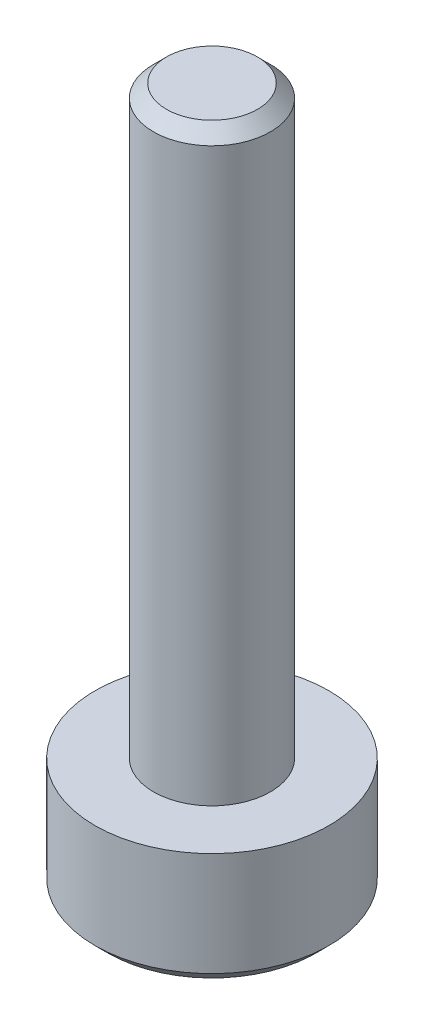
ISO-10303-21;
HEADER;
FILE_DESCRIPTION(('STEP AP214'),'2;1');
FILE_NAME('part.step','',(''),(''),'','','');
FILE_SCHEMA(('AUTOMOTIVE_DESIGN { 1 0 10303 214 1 1 1 1 }'));
ENDSEC;
DATA;
#1=APPLICATION_CONTEXT('core data for automotive mechanical design processes');
#2=APPLICATION_PROTOCOL_DEFINITION('international standard','automotive_design',2000,#1);
#3=PRODUCT_CONTEXT('',#1,'mechanical');
#4=PRODUCT('Part','Part','',(#3));
#5=PRODUCT_RELATED_PRODUCT_CATEGORY('part','',(#4));
#6=PRODUCT_DEFINITION_FORMATION('','',#4);
#7=PRODUCT_DEFINITION_CONTEXT('part definition',#1,'design');
#8=PRODUCT_DEFINITION('design','',#6,#7);
#9=PRODUCT_DEFINITION_SHAPE('','',#8);
#10=(LENGTH_UNIT() NAMED_UNIT(*) SI_UNIT(.MILLI.,.METRE.));
#11=(NAMED_UNIT(*) PLANE_ANGLE_UNIT() SI_UNIT($,.RADIAN.));
#12=(NAMED_UNIT(*) SI_UNIT($,.STERADIAN.) SOLID_ANGLE_UNIT());
#13=UNCERTAINTY_MEASURE_WITH_UNIT(LENGTH_MEASURE(1.E-05),#10,'distance_accuracy_value','');
#14=(GEOMETRIC_REPRESENTATION_CONTEXT(3) GLOBAL_UNCERTAINTY_ASSIGNED_CONTEXT((#13)) GLOBAL_UNIT_ASSIGNED_CONTEXT((#10,
#11,#12)) REPRESENTATION_CONTEXT('',''));
#15=CARTESIAN_POINT('',(0.,0.,0.));
#16=DIRECTION('',(0.,0.,1.));
#17=DIRECTION('',(1.,0.,0.));
#18=AXIS2_PLACEMENT_3D('',#15,#16,#17);
#19=CARTESIAN_POINT('',(0.,15.,0.));
#20=DIRECTION('',(0.,-1.,0.));
#21=DIRECTION('',(0.,0.,-1.));
#22=AXIS2_PLACEMENT_3D('',#19,#20,#21);
#23=CYLINDRICAL_SURFACE('',#22,1.5);
#24=CARTESIAN_POINT('',(0.,14.6666666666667,0.));
#25=DIRECTION('',(0.,1.,0.));
#26=DIRECTION('',(0.,0.,1.));
#27=AXIS2_PLACEMENT_3D('',#24,#25,#26);
#28=CIRCLE('',#27,1.5);
#29=CARTESIAN_POINT('',(0.,14.6666666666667,1.5));
#30=VERTEX_POINT('',#29);
#31=EDGE_CURVE('E182',#30,#30,#28,.F.);
#32=ORIENTED_EDGE('',*,*,#31,.T.);
#33=EDGE_LOOP('',(#32));
#34=FACE_BOUND('',#33,.T.);
#35=CARTESIAN_POINT('',(0.,0.,0.));
#36=DIRECTION('',(0.,1.,0.));
#37=DIRECTION('',(0.,0.,1.));
#38=AXIS2_PLACEMENT_3D('',#35,#36,#37);
#39=CIRCLE('',#38,1.5);
#40=CARTESIAN_POINT('',(0.,0.,1.5));
#41=VERTEX_POINT('',#40);
#42=EDGE_CURVE('E174',#41,#41,#39,.T.);
#43=ORIENTED_EDGE('',*,*,#42,.T.);
#44=EDGE_LOOP('',(#43));
#45=FACE_BOUND('',#44,.T.);
#46=ADVANCED_FACE('F45',(#34,#45),#23,.T.);
#47=CARTESIAN_POINT('',(0.,15.,0.));
#48=DIRECTION('',(0.,1.,0.));
#49=DIRECTION('',(0.,0.,1.));
#50=AXIS2_PLACEMENT_3D('',#47,#48,#49);
#51=PLANE('',#50);
#52=CARTESIAN_POINT('',(0.,15.,0.));
#53=DIRECTION('',(0.,1.,0.));
#54=DIRECTION('',(0.,0.,1.));
#55=AXIS2_PLACEMENT_3D('',#52,#53,#54);
#56=CIRCLE('',#55,1.16666666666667);
#57=CARTESIAN_POINT('',(0.,15.,1.16666666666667));
#58=VERTEX_POINT('',#57);
#59=EDGE_CURVE('E178',#58,#58,#56,.T.);
#60=ORIENTED_EDGE('',*,*,#59,.T.);
#61=EDGE_LOOP('',(#60));
#62=FACE_BOUND('',#61,.T.);
#63=ADVANCED_FACE('F201',(#62),#51,.T.);
#64=CARTESIAN_POINT('',(0.,-3.,0.));
#65=DIRECTION('',(0.,1.,0.));
#66=DIRECTION('',(0.,0.,1.));
#67=AXIS2_PLACEMENT_3D('',#64,#65,#66);
#68=CYLINDRICAL_SURFACE('',#67,3.);
#69=CARTESIAN_POINT('',(0.,-2.66666666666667,0.));
#70=DIRECTION('',(0.,-1.,0.));
#71=DIRECTION('',(0.,0.,-1.));
#72=AXIS2_PLACEMENT_3D('',#69,#70,#71);
#73=CIRCLE('',#72,3.);
#74=CARTESIAN_POINT('',(0.,-2.66666666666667,3.));
#75=VERTEX_POINT('',#74);
#76=EDGE_CURVE('E11',#75,#75,#73,.F.);
#77=ORIENTED_EDGE('',*,*,#76,.T.);
#78=EDGE_LOOP('',(#77));
#79=FACE_BOUND('',#78,.T.);
#80=CARTESIAN_POINT('',(0.,0.,0.));
#81=DIRECTION('',(0.,-1.,0.));
#82=DIRECTION('',(0.,0.,-1.));
#83=AXIS2_PLACEMENT_3D('',#80,#81,#82);
#84=CIRCLE('',#83,3.);
#85=CARTESIAN_POINT('',(0.,0.,-3.));
#86=VERTEX_POINT('',#85);
#87=EDGE_CURVE('E161',#86,#86,#84,.T.);
#88=ORIENTED_EDGE('',*,*,#87,.T.);
#89=EDGE_LOOP('',(#88));
#90=FACE_BOUND('',#89,.T.);
#91=ADVANCED_FACE('F207',(#79,#90),#68,.T.);
#92=CARTESIAN_POINT('',(0.,-3.,0.));
#93=DIRECTION('',(0.,-1.,0.));
#94=DIRECTION('',(0.,0.,-1.));
#95=AXIS2_PLACEMENT_3D('',#92,#93,#94);
#96=PLANE('',#95);
#97=CARTESIAN_POINT('',(0.,-3.,0.));
#98=DIRECTION('',(0.,-1.,0.));
#99=DIRECTION('',(0.,0.,-1.));
#100=AXIS2_PLACEMENT_3D('',#97,#98,#99);
#101=CIRCLE('',#100,2.66666666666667);
#102=CARTESIAN_POINT('',(0.,-3.,2.66666666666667));
#103=VERTEX_POINT('',#102);
#104=EDGE_CURVE('E55',#103,#103,#101,.T.);
#105=ORIENTED_EDGE('',*,*,#104,.T.);
#106=EDGE_LOOP('',(#105));
#107=FACE_BOUND('',#106,.T.);
#108=DIRECTION('',(-0.866025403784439,0.,0.5));
#109=VECTOR('',#108,1.);
#110=CARTESIAN_POINT('',(1.5,-3.,0.86602540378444));
#111=LINE('',#110,#109);
#112=CARTESIAN_POINT('',(1.5,-3.,0.86602540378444));
#113=VERTEX_POINT('',#112);
#114=CARTESIAN_POINT('',(0.,-3.,1.73205080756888));
#115=VERTEX_POINT('',#114);
#116=EDGE_CURVE('E62',#113,#115,#111,.T.);
#117=ORIENTED_EDGE('',*,*,#116,.F.);
#118=DIRECTION('',(0.,0.,1.));
#119=VECTOR('',#118,1.);
#120=CARTESIAN_POINT('',(1.5,-3.,-0.866025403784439));
#121=LINE('',#120,#119);
#122=CARTESIAN_POINT('',(1.5,-3.,-0.866025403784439));
#123=VERTEX_POINT('',#122);
#124=EDGE_CURVE('E155',#123,#113,#121,.T.);
#125=ORIENTED_EDGE('',*,*,#124,.F.);
#126=DIRECTION('',(0.866025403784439,0.,0.5));
#127=VECTOR('',#126,1.);
#128=CARTESIAN_POINT('',(0.,-3.,-1.73205080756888));
#129=LINE('',#128,#127);
#130=CARTESIAN_POINT('',(0.,-3.,-1.73205080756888));
#131=VERTEX_POINT('',#130);
#132=EDGE_CURVE('E152',#131,#123,#129,.T.);
#133=ORIENTED_EDGE('',*,*,#132,.F.);
#134=DIRECTION('',(0.866025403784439,0.,-0.5));
#135=VECTOR('',#134,1.);
#136=CARTESIAN_POINT('',(-1.5,-3.,-0.866025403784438));
#137=LINE('',#136,#135);
#138=CARTESIAN_POINT('',(-1.5,-3.,-0.866025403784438));
#139=VERTEX_POINT('',#138);
#140=EDGE_CURVE('E110',#139,#131,#137,.T.);
#141=ORIENTED_EDGE('',*,*,#140,.F.);
#142=DIRECTION('',(0.,0.,-1.));
#143=VECTOR('',#142,1.);
#144=CARTESIAN_POINT('',(-1.5,-3.,0.86602540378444));
#145=LINE('',#144,#143);
#146=CARTESIAN_POINT('',(-1.5,-3.,0.86602540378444));
#147=VERTEX_POINT('',#146);
#148=EDGE_CURVE('E146',#147,#139,#145,.T.);
#149=ORIENTED_EDGE('',*,*,#148,.F.);
#150=DIRECTION('',(-0.866025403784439,0.,-0.5));
#151=VECTOR('',#150,1.);
#152=CARTESIAN_POINT('',(0.,-3.,1.73205080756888));
#153=LINE('',#152,#151);
#154=EDGE_CURVE('E142',#115,#147,#153,.T.);
#155=ORIENTED_EDGE('',*,*,#154,.F.);
#156=EDGE_LOOP('',(#117,#125,#133,#141,#149,#155));
#157=FACE_BOUND('',#156,.T.);
#158=ADVANCED_FACE('F189',(#107,#157),#96,.T.);
#159=CARTESIAN_POINT('',(0.,0.,0.));
#160=DIRECTION('',(0.,-1.,0.));
#161=DIRECTION('',(0.,0.,-1.));
#162=AXIS2_PLACEMENT_3D('',#159,#160,#161);
#163=PLANE('',#162);
#164=ORIENTED_EDGE('',*,*,#42,.F.);
#165=EDGE_LOOP('',(#164));
#166=FACE_BOUND('',#165,.T.);
#167=ORIENTED_EDGE('',*,*,#87,.F.);
#168=EDGE_LOOP('',(#167));
#169=FACE_BOUND('',#168,.T.);
#170=ADVANCED_FACE('F220',(#166,#169),#163,.F.);
#171=CARTESIAN_POINT('',(1.5,-1.,0.86602540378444));
#172=DIRECTION('',(0.5,0.,0.866025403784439));
#173=DIRECTION('',(0.866025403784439,0.,-0.5));
#174=AXIS2_PLACEMENT_3D('',#171,#172,#173);
#175=PLANE('',#174);
#176=ORIENTED_EDGE('',*,*,#116,.T.);
#177=DIRECTION('',(0.,-1.,0.));
#178=VECTOR('',#177,1.);
#179=CARTESIAN_POINT('',(0.,-1.,1.73205080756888));
#180=LINE('',#179,#178);
#181=CARTESIAN_POINT('',(0.,-1.,1.73205080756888));
#182=VERTEX_POINT('',#181);
#183=EDGE_CURVE('E92',#182,#115,#180,.T.);
#184=ORIENTED_EDGE('',*,*,#183,.F.);
#185=DIRECTION('',(-0.866025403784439,0.,0.5));
#186=VECTOR('',#185,1.);
#187=CARTESIAN_POINT('',(1.5,-1.,0.86602540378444));
#188=LINE('',#187,#186);
#189=CARTESIAN_POINT('',(1.5,-1.,0.86602540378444));
#190=VERTEX_POINT('',#189);
#191=EDGE_CURVE('E158',#190,#182,#188,.T.);
#192=ORIENTED_EDGE('',*,*,#191,.F.);
#193=DIRECTION('',(0.,-1.,0.));
#194=VECTOR('',#193,1.);
#195=CARTESIAN_POINT('',(1.5,-1.,0.86602540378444));
#196=LINE('',#195,#194);
#197=EDGE_CURVE('E70',#190,#113,#196,.T.);
#198=ORIENTED_EDGE('',*,*,#197,.T.);
#199=EDGE_LOOP('',(#176,#184,#192,#198));
#200=FACE_BOUND('',#199,.T.);
#201=ADVANCED_FACE('F223',(#200),#175,.F.);
#202=CARTESIAN_POINT('',(1.5,-1.,-0.866025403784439));
#203=DIRECTION('',(1.,0.,0.));
#204=DIRECTION('',(0.,0.,-1.));
#205=AXIS2_PLACEMENT_3D('',#202,#203,#204);
#206=PLANE('',#205);
#207=ORIENTED_EDGE('',*,*,#124,.T.);
#208=ORIENTED_EDGE('',*,*,#197,.F.);
#209=DIRECTION('',(0.,0.,1.));
#210=VECTOR('',#209,1.);
#211=CARTESIAN_POINT('',(1.5,-1.,-0.866025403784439));
#212=LINE('',#211,#210);
#213=CARTESIAN_POINT('',(1.5,-1.,-0.866025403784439));
#214=VERTEX_POINT('',#213);
#215=EDGE_CURVE('E124',#214,#190,#212,.T.);
#216=ORIENTED_EDGE('',*,*,#215,.F.);
#217=DIRECTION('',(0.,-1.,0.));
#218=VECTOR('',#217,1.);
#219=CARTESIAN_POINT('',(1.5,-1.,-0.866025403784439));
#220=LINE('',#219,#218);
#221=EDGE_CURVE('E115',#214,#123,#220,.T.);
#222=ORIENTED_EDGE('',*,*,#221,.T.);
#223=EDGE_LOOP('',(#207,#208,#216,#222));
#224=FACE_BOUND('',#223,.T.);
#225=ADVANCED_FACE('F229',(#224),#206,.F.);
#226=CARTESIAN_POINT('',(0.,-1.,-1.73205080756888));
#227=DIRECTION('',(0.5,0.,-0.866025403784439));
#228=DIRECTION('',(-0.866025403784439,0.,-0.5));
#229=AXIS2_PLACEMENT_3D('',#226,#227,#228);
#230=PLANE('',#229);
#231=ORIENTED_EDGE('',*,*,#132,.T.);
#232=ORIENTED_EDGE('',*,*,#221,.F.);
#233=DIRECTION('',(0.866025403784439,0.,0.5));
#234=VECTOR('',#233,1.);
#235=CARTESIAN_POINT('',(0.,-1.,-1.73205080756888));
#236=LINE('',#235,#234);
#237=CARTESIAN_POINT('',(0.,-1.,-1.73205080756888));
#238=VERTEX_POINT('',#237);
#239=EDGE_CURVE('E119',#238,#214,#236,.T.);
#240=ORIENTED_EDGE('',*,*,#239,.F.);
#241=DIRECTION('',(0.,-1.,0.));
#242=VECTOR('',#241,1.);
#243=CARTESIAN_POINT('',(0.,-1.,-1.73205080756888));
#244=LINE('',#243,#242);
#245=EDGE_CURVE('E103',#238,#131,#244,.T.);
#246=ORIENTED_EDGE('',*,*,#245,.T.);
#247=EDGE_LOOP('',(#231,#232,#240,#246));
#248=FACE_BOUND('',#247,.T.);
#249=ADVANCED_FACE('F120',(#248),#230,.F.);
#250=CARTESIAN_POINT('',(-1.5,-1.,-0.866025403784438));
#251=DIRECTION('',(-0.5,0.,-0.866025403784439));
#252=DIRECTION('',(-0.866025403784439,0.,0.5));
#253=AXIS2_PLACEMENT_3D('',#250,#251,#252);
#254=PLANE('',#253);
#255=ORIENTED_EDGE('',*,*,#140,.T.);
#256=ORIENTED_EDGE('',*,*,#245,.F.);
#257=DIRECTION('',(0.866025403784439,0.,-0.5));
#258=VECTOR('',#257,1.);
#259=CARTESIAN_POINT('',(-1.5,-1.,-0.866025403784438));
#260=LINE('',#259,#258);
#261=CARTESIAN_POINT('',(-1.5,-1.,-0.866025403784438));
#262=VERTEX_POINT('',#261);
#263=EDGE_CURVE('E107',#262,#238,#260,.T.);
#264=ORIENTED_EDGE('',*,*,#263,.F.);
#265=DIRECTION('',(0.,-1.,0.));
#266=VECTOR('',#265,1.);
#267=CARTESIAN_POINT('',(-1.5,-1.,-0.866025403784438));
#268=LINE('',#267,#266);
#269=EDGE_CURVE('E116',#262,#139,#268,.T.);
#270=ORIENTED_EDGE('',*,*,#269,.T.);
#271=EDGE_LOOP('',(#255,#256,#264,#270));
#272=FACE_BOUND('',#271,.T.);
#273=ADVANCED_FACE('F105',(#272),#254,.F.);
#274=CARTESIAN_POINT('',(-1.5,-1.,0.86602540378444));
#275=DIRECTION('',(-1.,0.,0.));
#276=DIRECTION('',(0.,0.,1.));
#277=AXIS2_PLACEMENT_3D('',#274,#275,#276);
#278=PLANE('',#277);
#279=ORIENTED_EDGE('',*,*,#148,.T.);
#280=ORIENTED_EDGE('',*,*,#269,.F.);
#281=DIRECTION('',(0.,0.,-1.));
#282=VECTOR('',#281,1.);
#283=CARTESIAN_POINT('',(-1.5,-1.,0.86602540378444));
#284=LINE('',#283,#282);
#285=CARTESIAN_POINT('',(-1.5,-1.,0.86602540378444));
#286=VERTEX_POINT('',#285);
#287=EDGE_CURVE('E130',#286,#262,#284,.T.);
#288=ORIENTED_EDGE('',*,*,#287,.F.);
#289=DIRECTION('',(0.,-1.,0.));
#290=VECTOR('',#289,1.);
#291=CARTESIAN_POINT('',(-1.5,-1.,0.86602540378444));
#292=LINE('',#291,#290);
#293=EDGE_CURVE('E166',#286,#147,#292,.T.);
#294=ORIENTED_EDGE('',*,*,#293,.T.);
#295=EDGE_LOOP('',(#279,#280,#288,#294));
#296=FACE_BOUND('',#295,.T.);
#297=ADVANCED_FACE('F233',(#296),#278,.F.);
#298=CARTESIAN_POINT('',(0.,-1.,1.73205080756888));
#299=DIRECTION('',(-0.5,0.,0.866025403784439));
#300=DIRECTION('',(0.866025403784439,0.,0.5));
#301=AXIS2_PLACEMENT_3D('',#298,#299,#300);
#302=PLANE('',#301);
#303=ORIENTED_EDGE('',*,*,#154,.T.);
#304=ORIENTED_EDGE('',*,*,#293,.F.);
#305=DIRECTION('',(-0.866025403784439,0.,-0.5));
#306=VECTOR('',#305,1.);
#307=CARTESIAN_POINT('',(0.,-1.,1.73205080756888));
#308=LINE('',#307,#306);
#309=EDGE_CURVE('E134',#182,#286,#308,.T.);
#310=ORIENTED_EDGE('',*,*,#309,.F.);
#311=ORIENTED_EDGE('',*,*,#183,.T.);
#312=EDGE_LOOP('',(#303,#304,#310,#311));
#313=FACE_BOUND('',#312,.T.);
#314=ADVANCED_FACE('F230',(#313),#302,.F.);
#315=CARTESIAN_POINT('',(0.,-1.,0.));
#316=DIRECTION('',(0.,-1.,0.));
#317=DIRECTION('',(0.,0.,-1.));
#318=AXIS2_PLACEMENT_3D('',#315,#316,#317);
#319=PLANE('',#318);
#320=ORIENTED_EDGE('',*,*,#191,.T.);
#321=ORIENTED_EDGE('',*,*,#309,.T.);
#322=ORIENTED_EDGE('',*,*,#287,.T.);
#323=ORIENTED_EDGE('',*,*,#263,.T.);
#324=ORIENTED_EDGE('',*,*,#239,.T.);
#325=ORIENTED_EDGE('',*,*,#215,.T.);
#326=EDGE_LOOP('',(#320,#321,#322,#323,#324,#325));
#327=FACE_BOUND('',#326,.T.);
#328=ADVANCED_FACE('F127',(#327),#319,.T.);
#329=CARTESIAN_POINT('',(0.,15.,0.));
#330=DIRECTION('',(0.,-1.,0.));
#331=DIRECTION('',(0.,0.,-1.));
#332=AXIS2_PLACEMENT_3D('',#329,#330,#331);
#333=CONICAL_SURFACE('',#332,1.16666666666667,0.785398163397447);
#334=ORIENTED_EDGE('',*,*,#31,.F.);
#335=EDGE_LOOP('',(#334));
#336=FACE_BOUND('',#335,.T.);
#337=ORIENTED_EDGE('',*,*,#59,.F.);
#338=EDGE_LOOP('',(#337));
#339=FACE_BOUND('',#338,.T.);
#340=ADVANCED_FACE('F193',(#336,#339),#333,.T.);
#341=CARTESIAN_POINT('',(0.,-3.,0.));
#342=DIRECTION('',(0.,1.,0.));
#343=DIRECTION('',(0.,0.,1.));
#344=AXIS2_PLACEMENT_3D('',#341,#342,#343);
#345=CONICAL_SURFACE('',#344,2.66666666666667,0.785398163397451);
#346=CARTESIAN_POINT('',(0.,-2.66666666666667,3.));
#347=CARTESIAN_POINT('',(0.,-2.67013888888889,2.99652777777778));
#348=CARTESIAN_POINT('',(0.,-2.67361111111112,2.99305555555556));
#349=CARTESIAN_POINT('',(0.,-2.68055555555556,2.98611111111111));
#350=CARTESIAN_POINT('',(0.,-2.68402777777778,2.98263888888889));
#351=CARTESIAN_POINT('',(0.,-2.69097222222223,2.97569444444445));
#352=CARTESIAN_POINT('',(0.,-2.69444444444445,2.97222222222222));
#353=CARTESIAN_POINT('',(0.,-2.70138888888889,2.96527777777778));
#354=CARTESIAN_POINT('',(0.,-2.70486111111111,2.96180555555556));
#355=CARTESIAN_POINT('',(0.,-2.71180555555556,2.95486111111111));
#356=CARTESIAN_POINT('',(0.,-2.71527777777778,2.95138888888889));
#357=CARTESIAN_POINT('',(0.,-2.72222222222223,2.94444444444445));
#358=CARTESIAN_POINT('',(0.,-2.72569444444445,2.94097222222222));
#359=CARTESIAN_POINT('',(0.,-2.73263888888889,2.93402777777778));
#360=CARTESIAN_POINT('',(0.,-2.73611111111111,2.93055555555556));
#361=CARTESIAN_POINT('',(0.,-2.74305555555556,2.92361111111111));
#362=CARTESIAN_POINT('',(0.,-2.74652777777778,2.92013888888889));
#363=CARTESIAN_POINT('',(0.,-2.75347222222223,2.91319444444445));
#364=CARTESIAN_POINT('',(0.,-2.75694444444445,2.90972222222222));
#365=CARTESIAN_POINT('',(0.,-2.76388888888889,2.90277777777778));
#366=CARTESIAN_POINT('',(0.,-2.76736111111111,2.89930555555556));
#367=CARTESIAN_POINT('',(0.,-2.77430555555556,2.89236111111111));
#368=CARTESIAN_POINT('',(0.,-2.77777777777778,2.88888888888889));
#369=CARTESIAN_POINT('',(0.,-2.78472222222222,2.88194444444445));
#370=CARTESIAN_POINT('',(0.,-2.78819444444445,2.87847222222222));
#371=CARTESIAN_POINT('',(0.,-2.79513888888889,2.87152777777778));
#372=CARTESIAN_POINT('',(0.,-2.79861111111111,2.86805555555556));
#373=CARTESIAN_POINT('',(0.,-2.80555555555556,2.86111111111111));
#374=CARTESIAN_POINT('',(0.,-2.80902777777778,2.85763888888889));
#375=CARTESIAN_POINT('',(0.,-2.81597222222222,2.85069444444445));
#376=CARTESIAN_POINT('',(0.,-2.81944444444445,2.84722222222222));
#377=CARTESIAN_POINT('',(0.,-2.82638888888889,2.84027777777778));
#378=CARTESIAN_POINT('',(0.,-2.82986111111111,2.83680555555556));
#379=CARTESIAN_POINT('',(0.,-2.83680555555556,2.82986111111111));
#380=CARTESIAN_POINT('',(0.,-2.84027777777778,2.82638888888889));
#381=CARTESIAN_POINT('',(0.,-2.84722222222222,2.81944444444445));
#382=CARTESIAN_POINT('',(0.,-2.85069444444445,2.81597222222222));
#383=CARTESIAN_POINT('',(0.,-2.85763888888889,2.80902777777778));
#384=CARTESIAN_POINT('',(0.,-2.86111111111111,2.80555555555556));
#385=CARTESIAN_POINT('',(0.,-2.86805555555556,2.79861111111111));
#386=CARTESIAN_POINT('',(0.,-2.87152777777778,2.79513888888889));
#387=CARTESIAN_POINT('',(0.,-2.87847222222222,2.78819444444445));
#388=CARTESIAN_POINT('',(0.,-2.88194444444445,2.78472222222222));
#389=CARTESIAN_POINT('',(0.,-2.88888888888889,2.77777777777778));
#390=CARTESIAN_POINT('',(0.,-2.89236111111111,2.77430555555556));
#391=CARTESIAN_POINT('',(0.,-2.89930555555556,2.76736111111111));
#392=CARTESIAN_POINT('',(0.,-2.90277777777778,2.76388888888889));
#393=CARTESIAN_POINT('',(0.,-2.90972222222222,2.75694444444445));
#394=CARTESIAN_POINT('',(0.,-2.91319444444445,2.75347222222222));
#395=CARTESIAN_POINT('',(0.,-2.92013888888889,2.74652777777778));
#396=CARTESIAN_POINT('',(0.,-2.92361111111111,2.74305555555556));
#397=CARTESIAN_POINT('',(0.,-2.93055555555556,2.73611111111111));
#398=CARTESIAN_POINT('',(0.,-2.93402777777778,2.73263888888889));
#399=CARTESIAN_POINT('',(0.,-2.94097222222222,2.72569444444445));
#400=CARTESIAN_POINT('',(0.,-2.94444444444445,2.72222222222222));
#401=CARTESIAN_POINT('',(0.,-2.95138888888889,2.71527777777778));
#402=CARTESIAN_POINT('',(0.,-2.95486111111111,2.71180555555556));
#403=CARTESIAN_POINT('',(0.,-2.96180555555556,2.70486111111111));
#404=CARTESIAN_POINT('',(0.,-2.96527777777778,2.70138888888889));
#405=CARTESIAN_POINT('',(0.,-2.97222222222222,2.69444444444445));
#406=CARTESIAN_POINT('',(0.,-2.97569444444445,2.69097222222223));
#407=CARTESIAN_POINT('',(0.,-2.98263888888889,2.68402777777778));
#408=CARTESIAN_POINT('',(0.,-2.98611111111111,2.68055555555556));
#409=CARTESIAN_POINT('',(0.,-2.99305555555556,2.67361111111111));
#410=CARTESIAN_POINT('',(0.,-2.99652777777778,2.67013888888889));
#411=CARTESIAN_POINT('',(0.,-3.,2.66666666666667));
#412=B_SPLINE_CURVE_WITH_KNOTS('',3,(#346,#347,#348,#349,#350,#351,#352,#353,#354,#355,#356,
#357,#358,#359,#360,#361,#362,#363,#364,#365,#366,#367,#368,#369,#370,#371,#372,#373,#374,#375,
#376,#377,#378,#379,#380,#381,#382,#383,#384,#385,#386,#387,#388,#389,#390,#391,#392,#393,#394,
#395,#396,#397,#398,#399,#400,#401,#402,#403,#404,#405,#406,#407,#408,#409,#410,#411),
.UNSPECIFIED.,.F.,.F.,(4,2,2,2,2,2,2,2,2,2,2,2,2,2,2,2,2,2,2,2,2,2,2,2,2,2,2,2,2,2,2,2,4),(0.,
0.01473139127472,0.0294627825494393,0.044194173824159,0.0589255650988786,0.0736569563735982,
0.0883883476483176,0.103119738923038,0.117851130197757,0.132582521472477,0.147313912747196,
0.162045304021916,0.176776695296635,0.191508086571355,0.206239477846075,0.220970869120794,
0.235702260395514,0.250433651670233,0.265165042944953,0.279896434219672,0.294627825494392,
0.309359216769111,0.324090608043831,0.338821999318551,0.35355339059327,0.36828478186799,
0.38301617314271,0.397747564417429,0.412478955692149,0.427210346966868,0.441941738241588,
0.456673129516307,0.471404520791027),.UNSPECIFIED.);
#413=EDGE_CURVE('BSEAM48',#75,#103,#412,.T.);
#414=ORIENTED_EDGE('',*,*,#76,.F.);
#415=ORIENTED_EDGE('',*,*,#104,.F.);
#416=ORIENTED_EDGE('',*,*,#413,.T.);
#417=ORIENTED_EDGE('',*,*,#413,.F.);
#418=EDGE_LOOP('',(#414,#416,#415,#417));
#419=FACE_BOUND('',#418,.T.);
#420=ADVANCED_FACE('F48',(#419),#345,.T.);
#421=CLOSED_SHELL('',(#46,#63,#91,#158,#170,#201,#225,#249,#273,#297,#314,#328,#340,#420));
#422=MANIFOLD_SOLID_BREP('B2',#421);
#423=ADVANCED_BREP_SHAPE_REPRESENTATION('',(#18,#422),#14);
#424=SHAPE_DEFINITION_REPRESENTATION(#9,#423);
ENDSEC;
END-ISO-10303-21;
